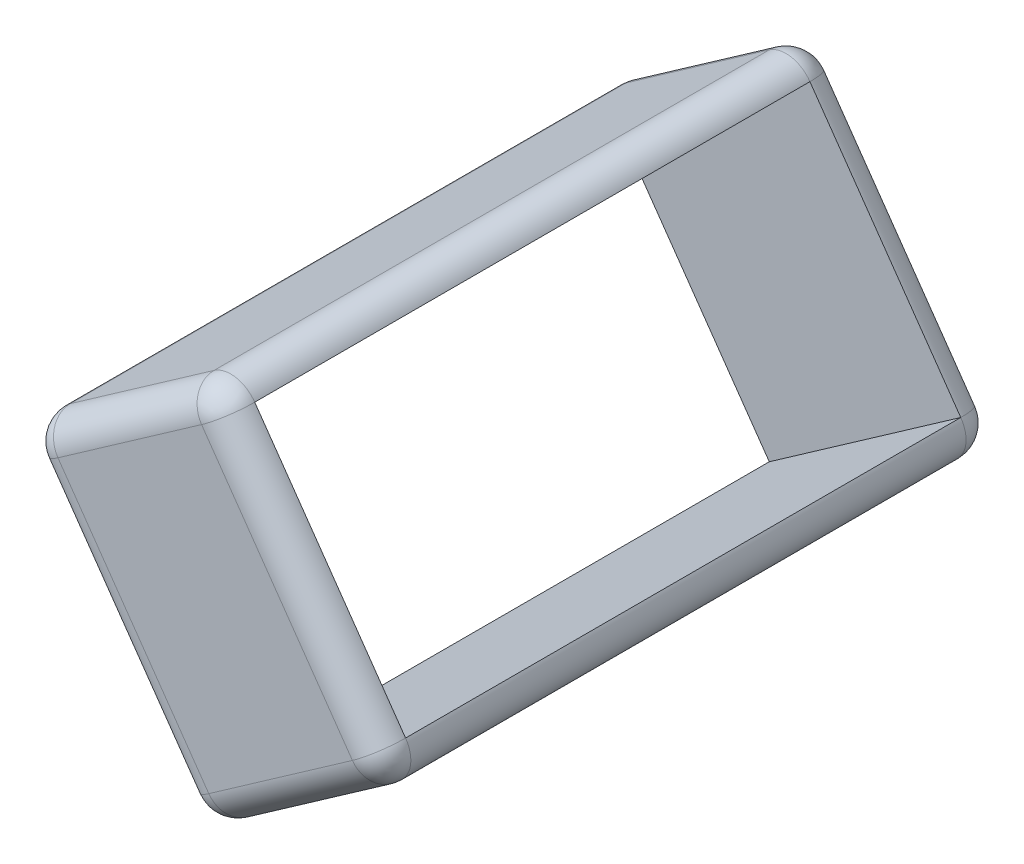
ISO-10303-21;
HEADER;
FILE_DESCRIPTION(('STEP AP214'),'2;1');
FILE_NAME('part.step','',(''),(''),'','','');
FILE_SCHEMA(('AUTOMOTIVE_DESIGN { 1 0 10303 214 1 1 1 1 }'));
ENDSEC;
DATA;
#1=APPLICATION_CONTEXT('core data for automotive mechanical design processes');
#2=APPLICATION_PROTOCOL_DEFINITION('international standard','automotive_design',2000,#1);
#3=PRODUCT_CONTEXT('',#1,'mechanical');
#4=PRODUCT('Part','Part','',(#3));
#5=PRODUCT_RELATED_PRODUCT_CATEGORY('part','',(#4));
#6=PRODUCT_DEFINITION_FORMATION('','',#4);
#7=PRODUCT_DEFINITION_CONTEXT('part definition',#1,'design');
#8=PRODUCT_DEFINITION('design','',#6,#7);
#9=PRODUCT_DEFINITION_SHAPE('','',#8);
#10=(LENGTH_UNIT() NAMED_UNIT(*) SI_UNIT(.MILLI.,.METRE.));
#11=(NAMED_UNIT(*) PLANE_ANGLE_UNIT() SI_UNIT($,.RADIAN.));
#12=(NAMED_UNIT(*) SI_UNIT($,.STERADIAN.) SOLID_ANGLE_UNIT());
#13=UNCERTAINTY_MEASURE_WITH_UNIT(LENGTH_MEASURE(1.E-05),#10,'distance_accuracy_value','');
#14=(GEOMETRIC_REPRESENTATION_CONTEXT(3) GLOBAL_UNCERTAINTY_ASSIGNED_CONTEXT((#13)) GLOBAL_UNIT_ASSIGNED_CONTEXT((#10,
#11,#12)) REPRESENTATION_CONTEXT('',''));
#15=CARTESIAN_POINT('',(0.,0.,0.));
#16=DIRECTION('',(0.,0.,1.));
#17=DIRECTION('',(1.,0.,0.));
#18=AXIS2_PLACEMENT_3D('',#15,#16,#17);
#19=CARTESIAN_POINT('',(11.0628027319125,-43.773106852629,10.5));
#20=DIRECTION('',(0.573576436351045,-0.819152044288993,0.));
#21=DIRECTION('',(0.819152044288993,0.573576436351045,0.));
#22=AXIS2_PLACEMENT_3D('',#19,#20,#21);
#23=PLANE('',#22);
#24=DIRECTION('',(0.,0.,-1.));
#25=VECTOR('',#24,1.);
#26=CARTESIAN_POINT('',(16.7968670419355,-39.7580717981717,10.5));
#27=LINE('',#26,#25);
#28=CARTESIAN_POINT('',(16.7968670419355,-39.7580717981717,9.5));
#29=VERTEX_POINT('',#28);
#30=CARTESIAN_POINT('',(16.7968670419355,-39.7580717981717,-9.5));
#31=VERTEX_POINT('',#30);
#32=EDGE_CURVE('E159',#29,#31,#27,.T.);
#33=ORIENTED_EDGE('',*,*,#32,.T.);
#34=DIRECTION('',(-0.819152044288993,-0.573576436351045,0.));
#35=VECTOR('',#34,1.);
#36=CARTESIAN_POINT('',(11.0628027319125,-43.773106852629,-9.5));
#37=LINE('',#36,#35);
#38=CARTESIAN_POINT('',(11.8819547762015,-43.199530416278,-9.5));
#39=VERTEX_POINT('',#38);
#40=EDGE_CURVE('E176',#31,#39,#37,.T.);
#41=ORIENTED_EDGE('',*,*,#40,.T.);
#42=DIRECTION('',(0.,0.,-1.));
#43=VECTOR('',#42,1.);
#44=CARTESIAN_POINT('',(11.8819547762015,-43.199530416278,10.5));
#45=LINE('',#44,#43);
#46=CARTESIAN_POINT('',(11.8819547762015,-43.199530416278,9.5));
#47=VERTEX_POINT('',#46);
#48=EDGE_CURVE('E279',#39,#47,#45,.F.);
#49=ORIENTED_EDGE('',*,*,#48,.T.);
#50=DIRECTION('',(-0.819152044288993,-0.573576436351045,0.));
#51=VECTOR('',#50,1.);
#52=CARTESIAN_POINT('',(17.6160190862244,-39.1844953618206,9.5));
#53=LINE('',#52,#51);
#54=EDGE_CURVE('E272',#47,#29,#53,.F.);
#55=ORIENTED_EDGE('',*,*,#54,.T.);
#56=EDGE_LOOP('',(#33,#41,#49,#55));
#57=FACE_BOUND('',#56,.T.);
#58=ADVANCED_FACE('F41',(#57),#23,.F.);
#59=CARTESIAN_POINT('',(23.9253598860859,-48.1951678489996,10.5));
#60=DIRECTION('',(-0.573576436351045,0.819152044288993,0.));
#61=DIRECTION('',(-0.819152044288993,-0.573576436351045,0.));
#62=AXIS2_PLACEMENT_3D('',#59,#60,#61);
#63=PLANE('',#62);
#64=DIRECTION('',(0.,0.,-1.));
#65=VECTOR('',#64,1.);
#66=CARTESIAN_POINT('',(18.191295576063,-52.2102029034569,10.5));
#67=LINE('',#66,#65);
#68=CARTESIAN_POINT('',(18.191295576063,-52.2102029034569,9.5));
#69=VERTEX_POINT('',#68);
#70=CARTESIAN_POINT('',(18.191295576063,-52.2102029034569,-9.5));
#71=VERTEX_POINT('',#70);
#72=EDGE_CURVE('E210',#69,#71,#67,.T.);
#73=ORIENTED_EDGE('',*,*,#72,.T.);
#74=DIRECTION('',(0.819152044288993,0.573576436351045,0.));
#75=VECTOR('',#74,1.);
#76=CARTESIAN_POINT('',(23.9253598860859,-48.1951678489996,-9.5));
#77=LINE('',#76,#75);
#78=CARTESIAN_POINT('',(23.1062078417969,-48.7687442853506,-9.5));
#79=VERTEX_POINT('',#78);
#80=EDGE_CURVE('E209',#71,#79,#77,.T.);
#81=ORIENTED_EDGE('',*,*,#80,.T.);
#82=DIRECTION('',(0.,0.,-1.));
#83=VECTOR('',#82,1.);
#84=CARTESIAN_POINT('',(23.1062078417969,-48.7687442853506,10.5));
#85=LINE('',#84,#83);
#86=CARTESIAN_POINT('',(23.1062078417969,-48.7687442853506,9.5));
#87=VERTEX_POINT('',#86);
#88=EDGE_CURVE('E202',#79,#87,#85,.F.);
#89=ORIENTED_EDGE('',*,*,#88,.T.);
#90=DIRECTION('',(0.819152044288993,0.573576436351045,0.));
#91=VECTOR('',#90,1.);
#92=CARTESIAN_POINT('',(17.372143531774,-52.7837793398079,9.5));
#93=LINE('',#92,#91);
#94=EDGE_CURVE('E201',#87,#69,#93,.F.);
#95=ORIENTED_EDGE('',*,*,#94,.T.);
#96=EDGE_LOOP('',(#73,#81,#89,#95));
#97=FACE_BOUND('',#96,.T.);
#98=ADVANCED_FACE('F340',(#97),#63,.F.);
#99=CARTESIAN_POINT('',(11.0628027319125,-43.773106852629,10.5));
#100=DIRECTION('',(0.,0.,1.));
#101=DIRECTION('',(1.,0.,0.));
#102=AXIS2_PLACEMENT_3D('',#99,#100,#101);
#103=PLANE('',#102);
#104=DIRECTION('',(0.819152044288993,0.573576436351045,0.));
#105=VECTOR('',#104,1.);
#106=CARTESIAN_POINT('',(23.3517834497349,-47.3760158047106,10.5));
#107=LINE('',#106,#105);
#108=CARTESIAN_POINT('',(17.6177191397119,-51.3910508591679,10.5));
#109=VERTEX_POINT('',#108);
#110=CARTESIAN_POINT('',(22.5326314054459,-47.9495922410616,10.5));
#111=VERTEX_POINT('',#110);
#112=EDGE_CURVE('E49',#109,#111,#107,.T.);
#113=ORIENTED_EDGE('',*,*,#112,.T.);
#114=DIRECTION('',(-0.573576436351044,0.819152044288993,0.));
#115=VECTOR('',#114,1.);
#116=CARTESIAN_POINT('',(16.7968670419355,-39.7580717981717,10.5));
#117=LINE('',#116,#115);
#118=CARTESIAN_POINT('',(17.3704434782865,-40.5772238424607,10.5));
#119=VERTEX_POINT('',#118);
#120=EDGE_CURVE('E11',#111,#119,#117,.T.);
#121=ORIENTED_EDGE('',*,*,#120,.T.);
#122=DIRECTION('',(-0.819152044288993,-0.573576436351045,0.));
#123=VECTOR('',#122,1.);
#124=CARTESIAN_POINT('',(11.6363791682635,-44.592258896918,10.5));
#125=LINE('',#124,#123);
#126=CARTESIAN_POINT('',(12.4555312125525,-44.0186824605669,10.5));
#127=VERTEX_POINT('',#126);
#128=EDGE_CURVE('E215',#119,#127,#125,.T.);
#129=ORIENTED_EDGE('',*,*,#128,.T.);
#130=DIRECTION('',(0.573576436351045,-0.819152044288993,0.));
#131=VECTOR('',#130,1.);
#132=CARTESIAN_POINT('',(18.191295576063,-52.2102029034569,10.5));
#133=LINE('',#132,#131);
#134=EDGE_CURVE('E63',#127,#109,#133,.T.);
#135=ORIENTED_EDGE('',*,*,#134,.T.);
#136=EDGE_LOOP('',(#113,#121,#129,#135));
#137=FACE_BOUND('',#136,.T.);
#138=ADVANCED_FACE('F339',(#137),#103,.T.);
#139=CARTESIAN_POINT('',(11.0628027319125,-43.773106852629,-10.5));
#140=DIRECTION('',(0.,0.,1.));
#141=DIRECTION('',(1.,0.,0.));
#142=AXIS2_PLACEMENT_3D('',#139,#140,#141);
#143=PLANE('',#142);
#144=DIRECTION('',(0.573576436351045,-0.819152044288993,0.));
#145=VECTOR('',#144,1.);
#146=CARTESIAN_POINT('',(11.8819547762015,-43.199530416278,-10.5));
#147=LINE('',#146,#145);
#148=CARTESIAN_POINT('',(17.6177191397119,-51.3910508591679,-10.5));
#149=VERTEX_POINT('',#148);
#150=CARTESIAN_POINT('',(12.4555312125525,-44.0186824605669,-10.5));
#151=VERTEX_POINT('',#150);
#152=EDGE_CURVE('E196',#149,#151,#147,.F.);
#153=ORIENTED_EDGE('',*,*,#152,.T.);
#154=DIRECTION('',(-0.819152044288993,-0.573576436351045,0.));
#155=VECTOR('',#154,1.);
#156=CARTESIAN_POINT('',(11.6363791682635,-44.592258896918,-10.5));
#157=LINE('',#156,#155);
#158=CARTESIAN_POINT('',(17.3704434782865,-40.5772238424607,-10.5));
#159=VERTEX_POINT('',#158);
#160=EDGE_CURVE('E203',#151,#159,#157,.F.);
#161=ORIENTED_EDGE('',*,*,#160,.T.);
#162=DIRECTION('',(-0.573576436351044,0.819152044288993,0.));
#163=VECTOR('',#162,1.);
#164=CARTESIAN_POINT('',(16.7968670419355,-39.7580717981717,-10.5));
#165=LINE('',#164,#163);
#166=CARTESIAN_POINT('',(22.5326314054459,-47.9495922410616,-10.5));
#167=VERTEX_POINT('',#166);
#168=EDGE_CURVE('E198',#159,#167,#165,.F.);
#169=ORIENTED_EDGE('',*,*,#168,.T.);
#170=DIRECTION('',(0.819152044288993,0.573576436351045,0.));
#171=VECTOR('',#170,1.);
#172=CARTESIAN_POINT('',(16.7985670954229,-51.9646272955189,-10.5));
#173=LINE('',#172,#171);
#174=EDGE_CURVE('E191',#167,#149,#173,.F.);
#175=ORIENTED_EDGE('',*,*,#174,.T.);
#176=EDGE_LOOP('',(#153,#161,#169,#175));
#177=FACE_BOUND('',#176,.T.);
#178=ADVANCED_FACE('F304',(#177),#143,.F.);
#179=CARTESIAN_POINT('',(17.6177191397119,-51.3910508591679,10.5));
#180=DIRECTION('',(0.,0.,-1.));
#181=DIRECTION('',(-1.,0.,0.));
#182=AXIS2_PLACEMENT_3D('',#179,#180,#181);
#183=CYLINDRICAL_SURFACE('',#182,1.);
#184=CARTESIAN_POINT('',(17.6177191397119,-51.3910508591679,9.5));
#185=DIRECTION('',(0.,0.,1.));
#186=DIRECTION('',(1.,0.,0.));
#187=AXIS2_PLACEMENT_3D('',#184,#185,#186);
#188=CIRCLE('',#187,1.);
#189=CARTESIAN_POINT('',(16.7985670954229,-51.9646272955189,9.5));
#190=VERTEX_POINT('',#189);
#191=EDGE_CURVE('E44',#190,#69,#188,.T.);
#192=ORIENTED_EDGE('',*,*,#191,.F.);
#193=DIRECTION('',(0.,0.,-1.));
#194=VECTOR('',#193,1.);
#195=CARTESIAN_POINT('',(16.7985670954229,-51.9646272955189,10.5));
#196=LINE('',#195,#194);
#197=CARTESIAN_POINT('',(16.7985670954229,-51.9646272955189,-9.5));
#198=VERTEX_POINT('',#197);
#199=EDGE_CURVE('E190',#198,#190,#196,.F.);
#200=ORIENTED_EDGE('',*,*,#199,.F.);
#201=CARTESIAN_POINT('',(17.6177191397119,-51.3910508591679,-9.5));
#202=DIRECTION('',(0.,0.,-1.));
#203=DIRECTION('',(-1.,0.,0.));
#204=AXIS2_PLACEMENT_3D('',#201,#202,#203);
#205=CIRCLE('',#204,1.);
#206=EDGE_CURVE('E266',#71,#198,#205,.T.);
#207=ORIENTED_EDGE('',*,*,#206,.F.);
#208=ORIENTED_EDGE('',*,*,#72,.F.);
#209=EDGE_LOOP('',(#192,#200,#207,#208));
#210=FACE_BOUND('',#209,.T.);
#211=ADVANCED_FACE('F43',(#210),#183,.T.);
#212=CARTESIAN_POINT('',(17.6177191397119,-51.3910508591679,9.5));
#213=DIRECTION('',(0.,0.,1.));
#214=DIRECTION('',(1.,0.,0.));
#215=AXIS2_PLACEMENT_3D('',#212,#213,#214);
#216=SPHERICAL_SURFACE('',#215,1.);
#217=CARTESIAN_POINT('',(17.6177191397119,-51.3910508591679,9.5));
#218=DIRECTION('',(0.573576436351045,-0.819152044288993,0.));
#219=DIRECTION('',(0.819152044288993,0.573576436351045,0.));
#220=AXIS2_PLACEMENT_3D('',#217,#218,#219);
#221=CIRCLE('',#220,1.);
#222=EDGE_CURVE('E265',#190,#109,#221,.F.);
#223=ORIENTED_EDGE('',*,*,#222,.F.);
#224=ORIENTED_EDGE('',*,*,#191,.T.);
#225=CARTESIAN_POINT('',(17.6177191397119,-51.3910508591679,9.5));
#226=DIRECTION('',(-0.819152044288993,-0.573576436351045,0.));
#227=DIRECTION('',(0.573576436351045,-0.819152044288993,0.));
#228=AXIS2_PLACEMENT_3D('',#225,#226,#227);
#229=CIRCLE('',#228,1.);
#230=EDGE_CURVE('E262',#109,#69,#229,.F.);
#231=ORIENTED_EDGE('',*,*,#230,.F.);
#232=EDGE_LOOP('',(#223,#224,#231));
#233=FACE_BOUND('',#232,.T.);
#234=ADVANCED_FACE('F328',(#233),#216,.T.);
#235=CARTESIAN_POINT('',(17.6177191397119,-51.3910508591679,-9.5));
#236=DIRECTION('',(0.,0.,1.));
#237=DIRECTION('',(1.,0.,0.));
#238=AXIS2_PLACEMENT_3D('',#235,#236,#237);
#239=SPHERICAL_SURFACE('',#238,1.);
#240=CARTESIAN_POINT('',(17.6177191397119,-51.3910508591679,-9.5));
#241=DIRECTION('',(-0.819152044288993,-0.573576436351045,0.));
#242=DIRECTION('',(0.573576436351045,-0.819152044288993,0.));
#243=AXIS2_PLACEMENT_3D('',#240,#241,#242);
#244=CIRCLE('',#243,1.);
#245=EDGE_CURVE('E258',#71,#149,#244,.F.);
#246=ORIENTED_EDGE('',*,*,#245,.F.);
#247=ORIENTED_EDGE('',*,*,#206,.T.);
#248=CARTESIAN_POINT('',(17.6177191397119,-51.3910508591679,-9.5));
#249=DIRECTION('',(0.573576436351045,-0.819152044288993,0.));
#250=DIRECTION('',(0.819152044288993,0.573576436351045,0.));
#251=AXIS2_PLACEMENT_3D('',#248,#249,#250);
#252=CIRCLE('',#251,1.);
#253=EDGE_CURVE('E259',#149,#198,#252,.F.);
#254=ORIENTED_EDGE('',*,*,#253,.F.);
#255=EDGE_LOOP('',(#246,#247,#254));
#256=FACE_BOUND('',#255,.T.);
#257=ADVANCED_FACE('F316',(#256),#239,.T.);
#258=CARTESIAN_POINT('',(16.7985670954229,-51.9646272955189,9.5));
#259=DIRECTION('',(-0.819152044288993,-0.573576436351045,0.));
#260=DIRECTION('',(0.573576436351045,-0.819152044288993,0.));
#261=AXIS2_PLACEMENT_3D('',#258,#259,#260);
#262=CYLINDRICAL_SURFACE('',#261,1.);
#263=ORIENTED_EDGE('',*,*,#230,.T.);
#264=ORIENTED_EDGE('',*,*,#94,.F.);
#265=CARTESIAN_POINT('',(22.5326314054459,-47.9495922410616,9.5));
#266=DIRECTION('',(0.819152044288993,0.573576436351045,0.));
#267=DIRECTION('',(-0.573576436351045,0.819152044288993,0.));
#268=AXIS2_PLACEMENT_3D('',#265,#266,#267);
#269=CIRCLE('',#268,1.);
#270=EDGE_CURVE('E248',#111,#87,#269,.T.);
#271=ORIENTED_EDGE('',*,*,#270,.F.);
#272=ORIENTED_EDGE('',*,*,#112,.F.);
#273=EDGE_LOOP('',(#263,#264,#271,#272));
#274=FACE_BOUND('',#273,.T.);
#275=ADVANCED_FACE('F394',(#274),#262,.T.);
#276=CARTESIAN_POINT('',(11.8819547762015,-43.199530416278,9.5));
#277=DIRECTION('',(-0.573576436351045,0.819152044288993,0.));
#278=DIRECTION('',(-0.819152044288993,-0.573576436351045,0.));
#279=AXIS2_PLACEMENT_3D('',#276,#277,#278);
#280=CYLINDRICAL_SURFACE('',#279,1.);
#281=ORIENTED_EDGE('',*,*,#222,.T.);
#282=ORIENTED_EDGE('',*,*,#134,.F.);
#283=CARTESIAN_POINT('',(12.4555312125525,-44.0186824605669,9.5));
#284=DIRECTION('',(-0.573576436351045,0.819152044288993,0.));
#285=DIRECTION('',(-0.819152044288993,-0.573576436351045,0.));
#286=AXIS2_PLACEMENT_3D('',#283,#284,#285);
#287=CIRCLE('',#286,1.);
#288=CARTESIAN_POINT('',(11.6363791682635,-44.592258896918,9.5));
#289=VERTEX_POINT('',#288);
#290=EDGE_CURVE('E250',#289,#127,#287,.T.);
#291=ORIENTED_EDGE('',*,*,#290,.F.);
#292=DIRECTION('',(0.573576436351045,-0.819152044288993,0.));
#293=VECTOR('',#292,1.);
#294=CARTESIAN_POINT('',(11.0628027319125,-43.773106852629,9.5));
#295=LINE('',#294,#293);
#296=EDGE_CURVE('E137',#190,#289,#295,.F.);
#297=ORIENTED_EDGE('',*,*,#296,.F.);
#298=EDGE_LOOP('',(#281,#282,#291,#297));
#299=FACE_BOUND('',#298,.T.);
#300=ADVANCED_FACE('F335',(#299),#280,.T.);
#301=CARTESIAN_POINT('',(12.4555312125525,-44.0186824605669,10.5));
#302=DIRECTION('',(0.,0.,-1.));
#303=DIRECTION('',(-1.,0.,0.));
#304=AXIS2_PLACEMENT_3D('',#301,#302,#303);
#305=CYLINDRICAL_SURFACE('',#304,1.);
#306=CARTESIAN_POINT('',(12.4555312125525,-44.0186824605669,-9.5));
#307=DIRECTION('',(0.,0.,-1.));
#308=DIRECTION('',(-1.,0.,0.));
#309=AXIS2_PLACEMENT_3D('',#306,#307,#308);
#310=CIRCLE('',#309,1.);
#311=CARTESIAN_POINT('',(11.6363791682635,-44.592258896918,-9.5));
#312=VERTEX_POINT('',#311);
#313=EDGE_CURVE('E241',#312,#39,#310,.T.);
#314=ORIENTED_EDGE('',*,*,#313,.F.);
#315=DIRECTION('',(0.,0.,-1.));
#316=VECTOR('',#315,1.);
#317=CARTESIAN_POINT('',(11.6363791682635,-44.592258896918,10.5));
#318=LINE('',#317,#316);
#319=EDGE_CURVE('E195',#289,#312,#318,.T.);
#320=ORIENTED_EDGE('',*,*,#319,.F.);
#321=CARTESIAN_POINT('',(12.4555312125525,-44.0186824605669,9.5));
#322=DIRECTION('',(0.,0.,1.));
#323=DIRECTION('',(1.,0.,0.));
#324=AXIS2_PLACEMENT_3D('',#321,#322,#323);
#325=CIRCLE('',#324,1.);
#326=EDGE_CURVE('E243',#47,#289,#325,.T.);
#327=ORIENTED_EDGE('',*,*,#326,.F.);
#328=ORIENTED_EDGE('',*,*,#48,.F.);
#329=EDGE_LOOP('',(#314,#320,#327,#328));
#330=FACE_BOUND('',#329,.T.);
#331=ADVANCED_FACE('F291',(#330),#305,.T.);
#332=CARTESIAN_POINT('',(18.191295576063,-52.2102029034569,-9.5));
#333=DIRECTION('',(0.573576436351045,-0.819152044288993,0.));
#334=DIRECTION('',(0.819152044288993,0.573576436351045,0.));
#335=AXIS2_PLACEMENT_3D('',#332,#333,#334);
#336=CYLINDRICAL_SURFACE('',#335,1.);
#337=ORIENTED_EDGE('',*,*,#253,.T.);
#338=DIRECTION('',(0.573576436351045,-0.819152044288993,0.));
#339=VECTOR('',#338,1.);
#340=CARTESIAN_POINT('',(17.372143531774,-52.7837793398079,-9.5));
#341=LINE('',#340,#339);
#342=EDGE_CURVE('E189',#312,#198,#341,.T.);
#343=ORIENTED_EDGE('',*,*,#342,.F.);
#344=CARTESIAN_POINT('',(12.4555312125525,-44.0186824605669,-9.5));
#345=DIRECTION('',(-0.573576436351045,0.819152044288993,0.));
#346=DIRECTION('',(-0.819152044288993,-0.573576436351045,0.));
#347=AXIS2_PLACEMENT_3D('',#344,#345,#346);
#348=CIRCLE('',#347,1.);
#349=EDGE_CURVE('E236',#151,#312,#348,.T.);
#350=ORIENTED_EDGE('',*,*,#349,.F.);
#351=ORIENTED_EDGE('',*,*,#152,.F.);
#352=EDGE_LOOP('',(#337,#343,#350,#351));
#353=FACE_BOUND('',#352,.T.);
#354=ADVANCED_FACE('F318',(#353),#336,.T.);
#355=CARTESIAN_POINT('',(23.3517834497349,-47.3760158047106,-9.5));
#356=DIRECTION('',(0.819152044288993,0.573576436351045,0.));
#357=DIRECTION('',(-0.573576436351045,0.819152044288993,0.));
#358=AXIS2_PLACEMENT_3D('',#355,#356,#357);
#359=CYLINDRICAL_SURFACE('',#358,1.);
#360=ORIENTED_EDGE('',*,*,#245,.T.);
#361=ORIENTED_EDGE('',*,*,#174,.F.);
#362=CARTESIAN_POINT('',(22.5326314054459,-47.9495922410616,-9.5));
#363=DIRECTION('',(0.819152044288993,0.573576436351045,0.));
#364=DIRECTION('',(-0.573576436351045,0.819152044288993,0.));
#365=AXIS2_PLACEMENT_3D('',#362,#363,#364);
#366=CIRCLE('',#365,1.);
#367=EDGE_CURVE('E233',#79,#167,#366,.T.);
#368=ORIENTED_EDGE('',*,*,#367,.F.);
#369=ORIENTED_EDGE('',*,*,#80,.F.);
#370=EDGE_LOOP('',(#360,#361,#368,#369));
#371=FACE_BOUND('',#370,.T.);
#372=ADVANCED_FACE('F312',(#371),#359,.T.);
#373=CARTESIAN_POINT('',(22.5326314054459,-47.9495922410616,10.5));
#374=DIRECTION('',(0.,0.,-1.));
#375=DIRECTION('',(-1.,0.,0.));
#376=AXIS2_PLACEMENT_3D('',#373,#374,#375);
#377=CYLINDRICAL_SURFACE('',#376,1.);
#378=CARTESIAN_POINT('',(22.5326314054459,-47.9495922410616,9.5));
#379=DIRECTION('',(0.,0.,1.));
#380=DIRECTION('',(1.,0.,0.));
#381=AXIS2_PLACEMENT_3D('',#378,#379,#380);
#382=CIRCLE('',#381,1.);
#383=CARTESIAN_POINT('',(23.3517834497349,-47.3760158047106,9.5));
#384=VERTEX_POINT('',#383);
#385=EDGE_CURVE('E251',#87,#384,#382,.T.);
#386=ORIENTED_EDGE('',*,*,#385,.F.);
#387=ORIENTED_EDGE('',*,*,#88,.F.);
#388=CARTESIAN_POINT('',(22.5326314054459,-47.9495922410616,-9.5));
#389=DIRECTION('',(0.,0.,-1.));
#390=DIRECTION('',(-1.,0.,0.));
#391=AXIS2_PLACEMENT_3D('',#388,#389,#390);
#392=CIRCLE('',#391,1.);
#393=CARTESIAN_POINT('',(23.3517834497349,-47.3760158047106,-9.5));
#394=VERTEX_POINT('',#393);
#395=EDGE_CURVE('E235',#394,#79,#392,.T.);
#396=ORIENTED_EDGE('',*,*,#395,.F.);
#397=DIRECTION('',(0.,0.,-1.));
#398=VECTOR('',#397,1.);
#399=CARTESIAN_POINT('',(23.3517834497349,-47.3760158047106,10.5));
#400=LINE('',#399,#398);
#401=EDGE_CURVE('E179',#384,#394,#400,.T.);
#402=ORIENTED_EDGE('',*,*,#401,.F.);
#403=EDGE_LOOP('',(#386,#387,#396,#402));
#404=FACE_BOUND('',#403,.T.);
#405=ADVANCED_FACE('F377',(#404),#377,.T.);
#406=CARTESIAN_POINT('',(22.5326314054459,-47.9495922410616,9.5));
#407=DIRECTION('',(0.,0.,1.));
#408=DIRECTION('',(1.,0.,0.));
#409=AXIS2_PLACEMENT_3D('',#406,#407,#408);
#410=SPHERICAL_SURFACE('',#409,1.);
#411=ORIENTED_EDGE('',*,*,#270,.T.);
#412=ORIENTED_EDGE('',*,*,#385,.T.);
#413=CARTESIAN_POINT('',(22.5326314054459,-47.9495922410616,9.5));
#414=DIRECTION('',(0.573576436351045,-0.819152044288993,0.));
#415=DIRECTION('',(0.819152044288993,0.573576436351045,0.));
#416=AXIS2_PLACEMENT_3D('',#413,#414,#415);
#417=CIRCLE('',#416,1.);
#418=EDGE_CURVE('E180',#111,#384,#417,.F.);
#419=ORIENTED_EDGE('',*,*,#418,.F.);
#420=EDGE_LOOP('',(#411,#412,#419));
#421=FACE_BOUND('',#420,.T.);
#422=ADVANCED_FACE('F376',(#421),#410,.T.);
#423=CARTESIAN_POINT('',(12.4555312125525,-44.0186824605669,9.5));
#424=DIRECTION('',(0.,0.,1.));
#425=DIRECTION('',(1.,0.,0.));
#426=AXIS2_PLACEMENT_3D('',#423,#424,#425);
#427=SPHERICAL_SURFACE('',#426,1.);
#428=ORIENTED_EDGE('',*,*,#326,.T.);
#429=ORIENTED_EDGE('',*,*,#290,.T.);
#430=CARTESIAN_POINT('',(12.4555312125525,-44.0186824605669,9.5));
#431=DIRECTION('',(-0.819152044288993,-0.573576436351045,0.));
#432=DIRECTION('',(0.573576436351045,-0.819152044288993,0.));
#433=AXIS2_PLACEMENT_3D('',#430,#431,#432);
#434=CIRCLE('',#433,1.);
#435=EDGE_CURVE('E227',#47,#127,#434,.F.);
#436=ORIENTED_EDGE('',*,*,#435,.F.);
#437=EDGE_LOOP('',(#428,#429,#436));
#438=FACE_BOUND('',#437,.T.);
#439=ADVANCED_FACE('F331',(#438),#427,.T.);
#440=CARTESIAN_POINT('',(12.4555312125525,-44.0186824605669,-9.5));
#441=DIRECTION('',(0.,0.,1.));
#442=DIRECTION('',(1.,0.,0.));
#443=AXIS2_PLACEMENT_3D('',#440,#441,#442);
#444=SPHERICAL_SURFACE('',#443,1.);
#445=ORIENTED_EDGE('',*,*,#349,.T.);
#446=ORIENTED_EDGE('',*,*,#313,.T.);
#447=CARTESIAN_POINT('',(12.4555312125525,-44.0186824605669,-9.5));
#448=DIRECTION('',(-0.819152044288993,-0.573576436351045,0.));
#449=DIRECTION('',(0.573576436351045,-0.819152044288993,0.));
#450=AXIS2_PLACEMENT_3D('',#447,#448,#449);
#451=CIRCLE('',#450,1.);
#452=EDGE_CURVE('E223',#151,#39,#451,.F.);
#453=ORIENTED_EDGE('',*,*,#452,.F.);
#454=EDGE_LOOP('',(#445,#446,#453));
#455=FACE_BOUND('',#454,.T.);
#456=ADVANCED_FACE('F297',(#455),#444,.T.);
#457=CARTESIAN_POINT('',(22.5326314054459,-47.9495922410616,-9.5));
#458=DIRECTION('',(0.,0.,1.));
#459=DIRECTION('',(1.,0.,0.));
#460=AXIS2_PLACEMENT_3D('',#457,#458,#459);
#461=SPHERICAL_SURFACE('',#460,1.);
#462=ORIENTED_EDGE('',*,*,#395,.T.);
#463=ORIENTED_EDGE('',*,*,#367,.T.);
#464=CARTESIAN_POINT('',(22.5326314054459,-47.9495922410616,-9.5));
#465=DIRECTION('',(0.573576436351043,-0.819152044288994,0.));
#466=DIRECTION('',(0.819152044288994,0.573576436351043,0.));
#467=AXIS2_PLACEMENT_3D('',#464,#465,#466);
#468=CIRCLE('',#467,1.);
#469=EDGE_CURVE('E174',#394,#167,#468,.F.);
#470=ORIENTED_EDGE('',*,*,#469,.F.);
#471=EDGE_LOOP('',(#462,#463,#470));
#472=FACE_BOUND('',#471,.T.);
#473=ADVANCED_FACE('F313',(#472),#461,.T.);
#474=CARTESIAN_POINT('',(16.7968670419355,-39.7580717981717,9.5));
#475=DIRECTION('',(0.573576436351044,-0.819152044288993,0.));
#476=DIRECTION('',(0.819152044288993,0.573576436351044,0.));
#477=AXIS2_PLACEMENT_3D('',#474,#475,#476);
#478=CYLINDRICAL_SURFACE('',#477,1.);
#479=ORIENTED_EDGE('',*,*,#418,.T.);
#480=DIRECTION('',(-0.573576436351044,0.819152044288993,0.));
#481=VECTOR('',#480,1.);
#482=CARTESIAN_POINT('',(23.9253598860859,-48.1951678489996,9.5));
#483=LINE('',#482,#481);
#484=CARTESIAN_POINT('',(18.1895955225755,-40.0036474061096,9.5));
#485=VERTEX_POINT('',#484);
#486=EDGE_CURVE('E132',#485,#384,#483,.F.);
#487=ORIENTED_EDGE('',*,*,#486,.F.);
#488=CARTESIAN_POINT('',(17.3704434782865,-40.5772238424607,9.5));
#489=DIRECTION('',(-0.573576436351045,0.819152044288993,0.));
#490=DIRECTION('',(-0.819152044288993,-0.573576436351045,0.));
#491=AXIS2_PLACEMENT_3D('',#488,#489,#490);
#492=CIRCLE('',#491,1.);
#493=EDGE_CURVE('E164',#119,#485,#492,.T.);
#494=ORIENTED_EDGE('',*,*,#493,.F.);
#495=ORIENTED_EDGE('',*,*,#120,.F.);
#496=EDGE_LOOP('',(#479,#487,#494,#495));
#497=FACE_BOUND('',#496,.T.);
#498=ADVANCED_FACE('F171',(#497),#478,.T.);
#499=CARTESIAN_POINT('',(11.6363791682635,-44.592258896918,9.5));
#500=DIRECTION('',(0.819152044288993,0.573576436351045,0.));
#501=DIRECTION('',(-0.573576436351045,0.819152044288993,0.));
#502=AXIS2_PLACEMENT_3D('',#499,#500,#501);
#503=CYLINDRICAL_SURFACE('',#502,1.);
#504=ORIENTED_EDGE('',*,*,#435,.T.);
#505=ORIENTED_EDGE('',*,*,#128,.F.);
#506=CARTESIAN_POINT('',(17.3704434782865,-40.5772238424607,9.5));
#507=DIRECTION('',(0.819152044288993,0.573576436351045,0.));
#508=DIRECTION('',(-0.573576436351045,0.819152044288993,0.));
#509=AXIS2_PLACEMENT_3D('',#506,#507,#508);
#510=CIRCLE('',#509,1.);
#511=EDGE_CURVE('E169',#29,#119,#510,.T.);
#512=ORIENTED_EDGE('',*,*,#511,.F.);
#513=ORIENTED_EDGE('',*,*,#54,.F.);
#514=EDGE_LOOP('',(#504,#505,#512,#513));
#515=FACE_BOUND('',#514,.T.);
#516=ADVANCED_FACE('F338',(#515),#503,.T.);
#517=CARTESIAN_POINT('',(11.6363791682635,-44.592258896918,-9.5));
#518=DIRECTION('',(-0.819152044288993,-0.573576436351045,0.));
#519=DIRECTION('',(0.573576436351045,-0.819152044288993,0.));
#520=AXIS2_PLACEMENT_3D('',#517,#518,#519);
#521=CYLINDRICAL_SURFACE('',#520,1.);
#522=ORIENTED_EDGE('',*,*,#452,.T.);
#523=ORIENTED_EDGE('',*,*,#40,.F.);
#524=CARTESIAN_POINT('',(17.3704434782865,-40.5772238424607,-9.5));
#525=DIRECTION('',(0.819152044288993,0.573576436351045,0.));
#526=DIRECTION('',(-0.573576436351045,0.819152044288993,0.));
#527=AXIS2_PLACEMENT_3D('',#524,#525,#526);
#528=CIRCLE('',#527,1.);
#529=EDGE_CURVE('E218',#159,#31,#528,.T.);
#530=ORIENTED_EDGE('',*,*,#529,.F.);
#531=ORIENTED_EDGE('',*,*,#160,.F.);
#532=EDGE_LOOP('',(#522,#523,#530,#531));
#533=FACE_BOUND('',#532,.T.);
#534=ADVANCED_FACE('F299',(#533),#521,.T.);
#535=CARTESIAN_POINT('',(16.7968670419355,-39.7580717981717,-9.5));
#536=DIRECTION('',(-0.573576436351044,0.819152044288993,0.));
#537=DIRECTION('',(-0.819152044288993,-0.573576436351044,0.));
#538=AXIS2_PLACEMENT_3D('',#535,#536,#537);
#539=CYLINDRICAL_SURFACE('',#538,1.);
#540=ORIENTED_EDGE('',*,*,#469,.T.);
#541=ORIENTED_EDGE('',*,*,#168,.F.);
#542=CARTESIAN_POINT('',(17.3704434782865,-40.5772238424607,-9.5));
#543=DIRECTION('',(-0.573576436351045,0.819152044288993,0.));
#544=DIRECTION('',(-0.819152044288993,-0.573576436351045,0.));
#545=AXIS2_PLACEMENT_3D('',#542,#543,#544);
#546=CIRCLE('',#545,1.);
#547=CARTESIAN_POINT('',(18.1895955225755,-40.0036474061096,-9.5));
#548=VERTEX_POINT('',#547);
#549=EDGE_CURVE('E165',#548,#159,#546,.T.);
#550=ORIENTED_EDGE('',*,*,#549,.F.);
#551=DIRECTION('',(-0.573576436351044,0.819152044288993,0.));
#552=VECTOR('',#551,1.);
#553=CARTESIAN_POINT('',(17.6160190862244,-39.1844953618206,-9.5));
#554=LINE('',#553,#552);
#555=EDGE_CURVE('E155',#394,#548,#554,.T.);
#556=ORIENTED_EDGE('',*,*,#555,.F.);
#557=EDGE_LOOP('',(#540,#541,#550,#556));
#558=FACE_BOUND('',#557,.T.);
#559=ADVANCED_FACE('F307',(#558),#539,.T.);
#560=CARTESIAN_POINT('',(17.3704434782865,-40.5772238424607,9.5));
#561=DIRECTION('',(0.,0.,1.));
#562=DIRECTION('',(1.,0.,0.));
#563=AXIS2_PLACEMENT_3D('',#560,#561,#562);
#564=SPHERICAL_SURFACE('',#563,1.);
#565=ORIENTED_EDGE('',*,*,#511,.T.);
#566=ORIENTED_EDGE('',*,*,#493,.T.);
#567=CARTESIAN_POINT('',(17.3704434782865,-40.5772238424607,9.5));
#568=DIRECTION('',(0.,0.,1.));
#569=DIRECTION('',(1.,0.,0.));
#570=AXIS2_PLACEMENT_3D('',#567,#568,#569);
#571=CIRCLE('',#570,1.);
#572=EDGE_CURVE('E156',#29,#485,#571,.F.);
#573=ORIENTED_EDGE('',*,*,#572,.F.);
#574=EDGE_LOOP('',(#565,#566,#573));
#575=FACE_BOUND('',#574,.T.);
#576=ADVANCED_FACE('F167',(#575),#564,.T.);
#577=CARTESIAN_POINT('',(17.3704434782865,-40.5772238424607,-9.5));
#578=DIRECTION('',(0.,0.,1.));
#579=DIRECTION('',(1.,0.,0.));
#580=AXIS2_PLACEMENT_3D('',#577,#578,#579);
#581=SPHERICAL_SURFACE('',#580,1.);
#582=ORIENTED_EDGE('',*,*,#549,.T.);
#583=ORIENTED_EDGE('',*,*,#529,.T.);
#584=CARTESIAN_POINT('',(17.3704434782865,-40.5772238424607,-9.5));
#585=DIRECTION('',(0.,0.,-1.));
#586=DIRECTION('',(-1.,0.,0.));
#587=AXIS2_PLACEMENT_3D('',#584,#585,#586);
#588=CIRCLE('',#587,1.);
#589=EDGE_CURVE('E138',#548,#31,#588,.F.);
#590=ORIENTED_EDGE('',*,*,#589,.F.);
#591=EDGE_LOOP('',(#582,#583,#590));
#592=FACE_BOUND('',#591,.T.);
#593=ADVANCED_FACE('F357',(#592),#581,.T.);
#594=CARTESIAN_POINT('',(17.3704434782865,-40.5772238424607,10.5));
#595=DIRECTION('',(0.,0.,-1.));
#596=DIRECTION('',(-1.,0.,0.));
#597=AXIS2_PLACEMENT_3D('',#594,#595,#596);
#598=CYLINDRICAL_SURFACE('',#597,1.);
#599=ORIENTED_EDGE('',*,*,#572,.T.);
#600=DIRECTION('',(0.,0.,-1.));
#601=VECTOR('',#600,1.);
#602=CARTESIAN_POINT('',(18.1895955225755,-40.0036474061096,10.5));
#603=LINE('',#602,#601);
#604=EDGE_CURVE('E144',#548,#485,#603,.F.);
#605=ORIENTED_EDGE('',*,*,#604,.F.);
#606=ORIENTED_EDGE('',*,*,#589,.T.);
#607=ORIENTED_EDGE('',*,*,#32,.F.);
#608=EDGE_LOOP('',(#599,#605,#606,#607));
#609=FACE_BOUND('',#608,.T.);
#610=ADVANCED_FACE('F158',(#609),#598,.T.);
#611=CARTESIAN_POINT('',(11.6363791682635,-44.592258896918,10.5));
#612=DIRECTION('',(0.573576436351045,-0.819152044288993,0.));
#613=DIRECTION('',(0.819152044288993,0.573576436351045,0.));
#614=AXIS2_PLACEMENT_3D('',#611,#612,#613);
#615=PLANE('',#614);
#616=ORIENTED_EDGE('',*,*,#604,.T.);
#617=DIRECTION('',(-0.819152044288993,-0.573576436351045,0.));
#618=VECTOR('',#617,1.);
#619=CARTESIAN_POINT('',(11.6363791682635,-44.592258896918,9.5));
#620=LINE('',#619,#618);
#621=EDGE_CURVE('E129',#485,#289,#620,.T.);
#622=ORIENTED_EDGE('',*,*,#621,.T.);
#623=ORIENTED_EDGE('',*,*,#319,.T.);
#624=DIRECTION('',(-0.819152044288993,-0.573576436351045,0.));
#625=VECTOR('',#624,1.);
#626=CARTESIAN_POINT('',(11.6363791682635,-44.592258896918,-9.5));
#627=LINE('',#626,#625);
#628=EDGE_CURVE('E146',#548,#312,#627,.T.);
#629=ORIENTED_EDGE('',*,*,#628,.F.);
#630=EDGE_LOOP('',(#616,#622,#623,#629));
#631=FACE_BOUND('',#630,.T.);
#632=ADVANCED_FACE('F150',(#631),#615,.T.);
#633=CARTESIAN_POINT('',(23.3517834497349,-47.3760158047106,10.5));
#634=DIRECTION('',(-0.573576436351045,0.819152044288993,0.));
#635=DIRECTION('',(-0.819152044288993,-0.573576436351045,0.));
#636=AXIS2_PLACEMENT_3D('',#633,#634,#635);
#637=PLANE('',#636);
#638=ORIENTED_EDGE('',*,*,#199,.T.);
#639=DIRECTION('',(-0.819152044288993,-0.573576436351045,0.));
#640=VECTOR('',#639,1.);
#641=CARTESIAN_POINT('',(16.7985670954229,-51.9646272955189,9.5));
#642=LINE('',#641,#640);
#643=EDGE_CURVE('E143',#384,#190,#642,.T.);
#644=ORIENTED_EDGE('',*,*,#643,.F.);
#645=ORIENTED_EDGE('',*,*,#401,.T.);
#646=DIRECTION('',(-0.819152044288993,-0.573576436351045,0.));
#647=VECTOR('',#646,1.);
#648=CARTESIAN_POINT('',(16.7985670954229,-51.9646272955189,-9.5));
#649=LINE('',#648,#647);
#650=EDGE_CURVE('E285',#394,#198,#649,.T.);
#651=ORIENTED_EDGE('',*,*,#650,.T.);
#652=EDGE_LOOP('',(#638,#644,#645,#651));
#653=FACE_BOUND('',#652,.T.);
#654=ADVANCED_FACE('F324',(#653),#637,.T.);
#655=CARTESIAN_POINT('',(11.0628027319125,-43.773106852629,9.5));
#656=DIRECTION('',(0.,0.,1.));
#657=DIRECTION('',(1.,0.,0.));
#658=AXIS2_PLACEMENT_3D('',#655,#656,#657);
#659=PLANE('',#658);
#660=ORIENTED_EDGE('',*,*,#643,.T.);
#661=ORIENTED_EDGE('',*,*,#296,.T.);
#662=ORIENTED_EDGE('',*,*,#621,.F.);
#663=ORIENTED_EDGE('',*,*,#486,.T.);
#664=EDGE_LOOP('',(#660,#661,#662,#663));
#665=FACE_BOUND('',#664,.T.);
#666=ADVANCED_FACE('F131',(#665),#659,.F.);
#667=CARTESIAN_POINT('',(11.0628027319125,-43.773106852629,-9.5));
#668=DIRECTION('',(0.,0.,1.));
#669=DIRECTION('',(1.,0.,0.));
#670=AXIS2_PLACEMENT_3D('',#667,#668,#669);
#671=PLANE('',#670);
#672=ORIENTED_EDGE('',*,*,#342,.T.);
#673=ORIENTED_EDGE('',*,*,#650,.F.);
#674=ORIENTED_EDGE('',*,*,#555,.T.);
#675=ORIENTED_EDGE('',*,*,#628,.T.);
#676=EDGE_LOOP('',(#672,#673,#674,#675));
#677=FACE_BOUND('',#676,.T.);
#678=ADVANCED_FACE('F325',(#677),#671,.T.);
#679=CLOSED_SHELL('',(#58,#98,#138,#178,#211,#234,#257,#275,#300,#331,#354,#372,#405,#422,#439,
#456,#473,#498,#516,#534,#559,#576,#593,#610,#632,#654,#666,#678));
#680=MANIFOLD_SOLID_BREP('B2',#679);
#681=ADVANCED_BREP_SHAPE_REPRESENTATION('',(#18,#680),#14);
#682=SHAPE_DEFINITION_REPRESENTATION(#9,#681);
ENDSEC;
END-ISO-10303-21;
